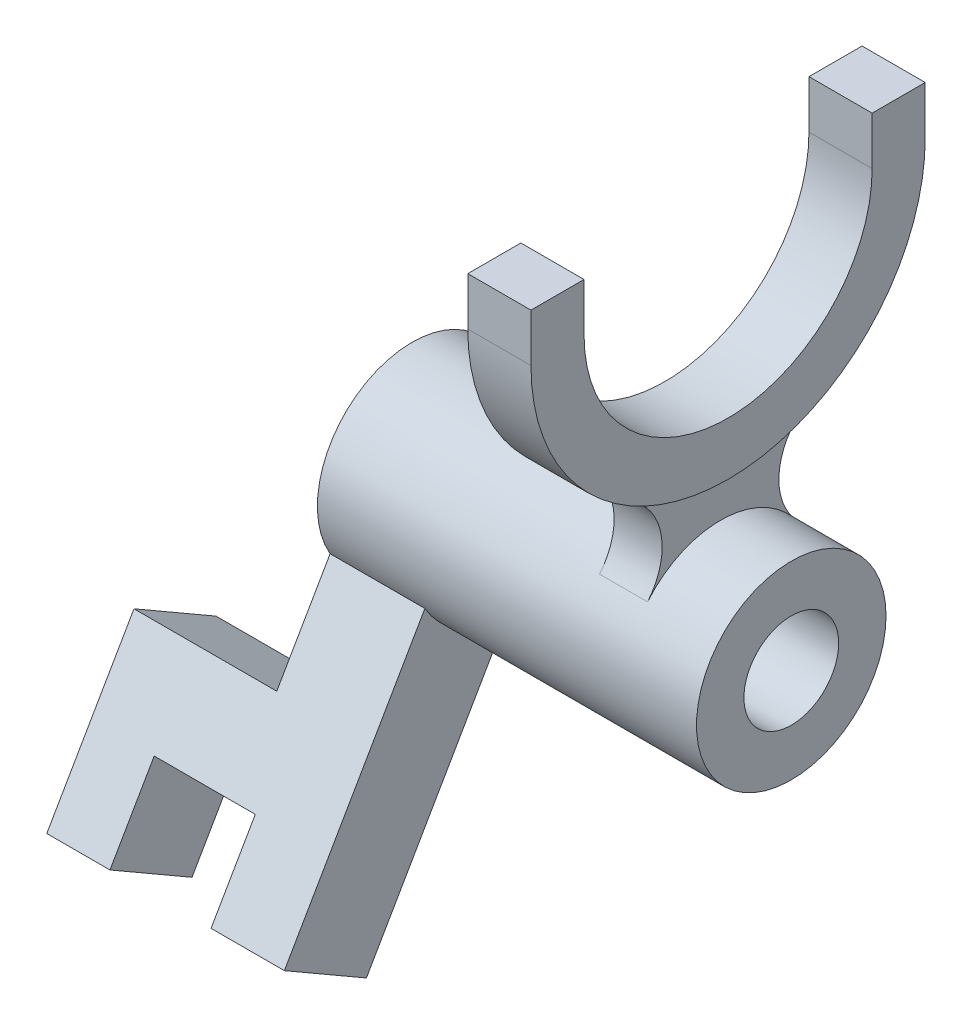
from build123d import *

# Parameters (mm, degrees)
EXTRUDE1_DEPTH      = 19.05
EXTRUDE1_DEPTH_BACK = 57.15
SKETCH1_R           = 19.05
SKETCH1_R_2         = 9.525
EXTRUDE_THIN1_DEPTH = 6.35
EXTRUDE2_DEPTH      = 4.826
EXTRUDE3_DEPTH      = 9.525


with BuildPart() as part:
    # Sketch1 → Extrude1 (new, two sides: drawn at the far end of the back side and taken through both)
    with BuildSketch(Plane(origin=(0, 0, 0), x_dir=(0, 0, -1), z_dir=(1, 0, 0)).offset(-EXTRUDE1_DEPTH_BACK)):
        Circle(SKETCH1_R)
        Circle(SKETCH1_R_2, mode=Mode.SUBTRACT)
    extrude(amount=EXTRUDE1_DEPTH + EXTRUDE1_DEPTH_BACK)



with BuildPart() as body_2:
    # Sketch2 → Extrude-Thin1 (new, symmetric)
    with BuildSketch(Plane(origin=(0, 0, 0), x_dir=(0, 0, -1), z_dir=(1, 0, 0))):
        with BuildLine():
            Line((39.624, 76.2), (39.624, 66.548))
            ThreePointArc((39.624, 66.548), (0, 26.924), (-39.624, 66.548))
            Line((-39.624, 66.548), (-39.624, 76.2))
            Line((-39.624, 76.2), (-28.956, 76.2))
            Line((-28.956, 76.2), (-28.956, 66.548))
            ThreePointArc((-28.956, 66.548), (0, 37.592), (28.956, 66.548))
            Line((28.956, 66.548), (28.956, 76.2))
            Line((28.956, 76.2), (39.624, 76.2))
        make_face()
    extrude(amount=EXTRUDE_THIN1_DEPTH, both=True)


with BuildPart() as part_1:
    add(part.part)

    add(body_2.part)  # Extrude2 merges body 2
    # Sketch4 → Extrude2 (add, symmetric)
    with BuildSketch(Plane(origin=(0, 0, 0), x_dir=(0, 0, -1), z_dir=(1, 0, 0))):
        with BuildLine():
            ThreePointArc((14.658580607, 12.166696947), (0, 19.05), (-14.658580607, 12.166696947))
            ThreePointArc((-14.658580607, 12.166696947), (-11.974406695, 22.752517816), (-18.501121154, 31.508452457))
            ThreePointArc((-18.501121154, 31.508452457), (0, 26.924), (18.501121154, 31.508452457))
            ThreePointArc((18.501121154, 31.508452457), (11.974406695, 22.752517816), (14.658580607, 12.166696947))
        make_face()
    extrude(amount=EXTRUDE2_DEPTH, both=True)

    # Sketch5 → Extrude3 (add, symmetric)
    with BuildSketch(Plane(origin=(0, 0, 0), x_dir=(1, 0, 0), z_dir=(0, 0.500000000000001, 0.8660254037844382))):
        Polygon((-57.15, -9.525), (-57.15, -37.940621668), (-85.852, -37.940621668), (-85.852, -72.992621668), (-73.152, -72.992621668), (-73.152, -55.212621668), (-52.832, -55.212621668), (-52.832, -72.992621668), (-38.1, -72.992621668), (-38.1, -9.525), align=None)
    extrude(amount=EXTRUDE3_DEPTH, both=True)


solid = part_1.part
